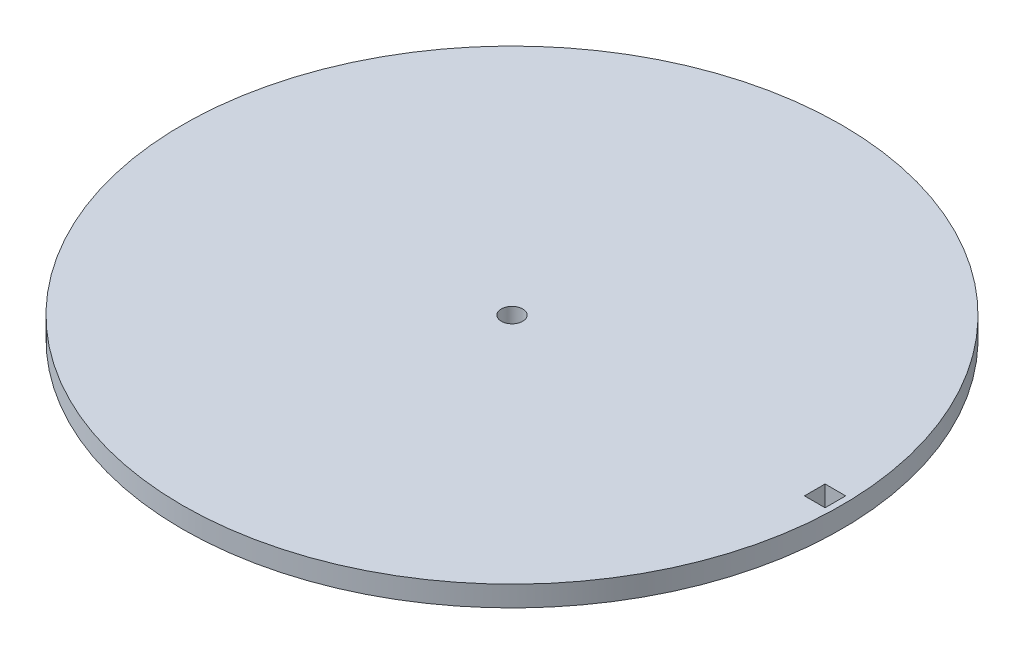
ISO-10303-21;
HEADER;
FILE_DESCRIPTION(('STEP AP214'),'2;1');
FILE_NAME('part.step','',(''),(''),'','','');
FILE_SCHEMA(('AUTOMOTIVE_DESIGN { 1 0 10303 214 1 1 1 1 }'));
ENDSEC;
DATA;
#1=APPLICATION_CONTEXT('core data for automotive mechanical design processes');
#2=APPLICATION_PROTOCOL_DEFINITION('international standard','automotive_design',2000,#1);
#3=PRODUCT_CONTEXT('',#1,'mechanical');
#4=PRODUCT('Part','Part','',(#3));
#5=PRODUCT_RELATED_PRODUCT_CATEGORY('part','',(#4));
#6=PRODUCT_DEFINITION_FORMATION('','',#4);
#7=PRODUCT_DEFINITION_CONTEXT('part definition',#1,'design');
#8=PRODUCT_DEFINITION('design','',#6,#7);
#9=PRODUCT_DEFINITION_SHAPE('','',#8);
#10=(LENGTH_UNIT() NAMED_UNIT(*) SI_UNIT(.MILLI.,.METRE.));
#11=(NAMED_UNIT(*) PLANE_ANGLE_UNIT() SI_UNIT($,.RADIAN.));
#12=(NAMED_UNIT(*) SI_UNIT($,.STERADIAN.) SOLID_ANGLE_UNIT());
#13=UNCERTAINTY_MEASURE_WITH_UNIT(LENGTH_MEASURE(1.E-05),#10,'distance_accuracy_value','');
#14=(GEOMETRIC_REPRESENTATION_CONTEXT(3) GLOBAL_UNCERTAINTY_ASSIGNED_CONTEXT((#13)) GLOBAL_UNIT_ASSIGNED_CONTEXT((#10,
#11,#12)) REPRESENTATION_CONTEXT('',''));
#15=CARTESIAN_POINT('',(0.,0.,0.));
#16=DIRECTION('',(0.,0.,1.));
#17=DIRECTION('',(1.,0.,0.));
#18=AXIS2_PLACEMENT_3D('',#15,#16,#17);
#19=CARTESIAN_POINT('',(0.,3.175,0.));
#20=DIRECTION('',(0.,-1.,0.));
#21=DIRECTION('',(0.,0.,-1.));
#22=AXIS2_PLACEMENT_3D('',#19,#20,#21);
#23=CYLINDRICAL_SURFACE('',#22,50.8);
#24=CARTESIAN_POINT('',(0.,3.175,0.));
#25=DIRECTION('',(0.,1.,0.));
#26=DIRECTION('',(0.,0.,1.));
#27=AXIS2_PLACEMENT_3D('',#24,#25,#26);
#28=CIRCLE('',#27,50.8);
#29=CARTESIAN_POINT('',(0.,3.175,50.8));
#30=VERTEX_POINT('',#29);
#31=EDGE_CURVE('E11',#30,#30,#28,.T.);
#32=ORIENTED_EDGE('',*,*,#31,.F.);
#33=EDGE_LOOP('',(#32));
#34=FACE_BOUND('',#33,.T.);
#35=CARTESIAN_POINT('',(0.,0.,0.));
#36=DIRECTION('',(0.,1.,0.));
#37=DIRECTION('',(0.,0.,1.));
#38=AXIS2_PLACEMENT_3D('',#35,#36,#37);
#39=CIRCLE('',#38,50.8);
#40=CARTESIAN_POINT('',(0.,0.,50.8));
#41=VERTEX_POINT('',#40);
#42=EDGE_CURVE('E35',#41,#41,#39,.T.);
#43=ORIENTED_EDGE('',*,*,#42,.T.);
#44=EDGE_LOOP('',(#43));
#45=FACE_BOUND('',#44,.T.);
#46=ADVANCED_FACE('F32',(#34,#45),#23,.T.);
#47=CARTESIAN_POINT('',(0.,3.175,0.));
#48=DIRECTION('',(0.,1.,0.));
#49=DIRECTION('',(0.,0.,1.));
#50=AXIS2_PLACEMENT_3D('',#47,#48,#49);
#51=PLANE('',#50);
#52=DIRECTION('',(0.,0.,1.));
#53=VECTOR('',#52,1.);
#54=CARTESIAN_POINT('',(46.6725,3.175,1.5875));
#55=LINE('',#54,#53);
#56=CARTESIAN_POINT('',(46.6725,3.175,-1.5875));
#57=VERTEX_POINT('',#56);
#58=CARTESIAN_POINT('',(46.6725,3.175,1.5875));
#59=VERTEX_POINT('',#58);
#60=EDGE_CURVE('E46',#57,#59,#55,.T.);
#61=ORIENTED_EDGE('',*,*,#60,.F.);
#62=DIRECTION('',(-1.,0.,0.));
#63=VECTOR('',#62,1.);
#64=CARTESIAN_POINT('',(49.8475,3.175,-1.5875));
#65=LINE('',#64,#63);
#66=CARTESIAN_POINT('',(49.8475,3.175,-1.5875));
#67=VERTEX_POINT('',#66);
#68=EDGE_CURVE('E90',#67,#57,#65,.T.);
#69=ORIENTED_EDGE('',*,*,#68,.F.);
#70=DIRECTION('',(0.,0.,-1.));
#71=VECTOR('',#70,1.);
#72=CARTESIAN_POINT('',(49.8475,3.175,1.5875));
#73=LINE('',#72,#71);
#74=CARTESIAN_POINT('',(49.8475,3.175,1.5875));
#75=VERTEX_POINT('',#74);
#76=EDGE_CURVE('E93',#75,#67,#73,.T.);
#77=ORIENTED_EDGE('',*,*,#76,.F.);
#78=DIRECTION('',(1.,0.,0.));
#79=VECTOR('',#78,1.);
#80=CARTESIAN_POINT('',(49.8475,3.175,1.5875));
#81=LINE('',#80,#79);
#82=EDGE_CURVE('E99',#59,#75,#81,.T.);
#83=ORIENTED_EDGE('',*,*,#82,.F.);
#84=EDGE_LOOP('',(#61,#69,#77,#83));
#85=FACE_BOUND('',#84,.T.);
#86=CARTESIAN_POINT('',(0.,3.175,0.));
#87=DIRECTION('',(0.,-1.,0.));
#88=DIRECTION('',(0.,0.,-1.));
#89=AXIS2_PLACEMENT_3D('',#86,#87,#88);
#90=CIRCLE('',#89,1.651);
#91=CARTESIAN_POINT('',(0.,3.175,-1.651));
#92=VERTEX_POINT('',#91);
#93=EDGE_CURVE('E109',#92,#92,#90,.T.);
#94=ORIENTED_EDGE('',*,*,#93,.T.);
#95=EDGE_LOOP('',(#94));
#96=FACE_BOUND('',#95,.T.);
#97=ORIENTED_EDGE('',*,*,#31,.T.);
#98=EDGE_LOOP('',(#97));
#99=FACE_BOUND('',#98,.T.);
#100=ADVANCED_FACE('F118',(#85,#96,#99),#51,.T.);
#101=CARTESIAN_POINT('',(0.,0.,0.));
#102=DIRECTION('',(0.,1.,0.));
#103=DIRECTION('',(0.,0.,1.));
#104=AXIS2_PLACEMENT_3D('',#101,#102,#103);
#105=PLANE('',#104);
#106=DIRECTION('',(-1.,0.,0.));
#107=VECTOR('',#106,1.);
#108=CARTESIAN_POINT('',(49.8475,0.,-1.5875));
#109=LINE('',#108,#107);
#110=CARTESIAN_POINT('',(49.8475,0.,-1.5875));
#111=VERTEX_POINT('',#110);
#112=CARTESIAN_POINT('',(46.6725,0.,-1.5875));
#113=VERTEX_POINT('',#112);
#114=EDGE_CURVE('E80',#111,#113,#109,.T.);
#115=ORIENTED_EDGE('',*,*,#114,.T.);
#116=DIRECTION('',(0.,0.,1.));
#117=VECTOR('',#116,1.);
#118=CARTESIAN_POINT('',(46.6725,0.,1.5875));
#119=LINE('',#118,#117);
#120=CARTESIAN_POINT('',(46.6725,0.,1.5875));
#121=VERTEX_POINT('',#120);
#122=EDGE_CURVE('E74',#113,#121,#119,.T.);
#123=ORIENTED_EDGE('',*,*,#122,.T.);
#124=DIRECTION('',(1.,0.,0.));
#125=VECTOR('',#124,1.);
#126=CARTESIAN_POINT('',(49.8475,0.,1.5875));
#127=LINE('',#126,#125);
#128=CARTESIAN_POINT('',(49.8475,0.,1.5875));
#129=VERTEX_POINT('',#128);
#130=EDGE_CURVE('E83',#121,#129,#127,.T.);
#131=ORIENTED_EDGE('',*,*,#130,.T.);
#132=DIRECTION('',(0.,0.,-1.));
#133=VECTOR('',#132,1.);
#134=CARTESIAN_POINT('',(49.8475,0.,1.5875));
#135=LINE('',#134,#133);
#136=EDGE_CURVE('E54',#129,#111,#135,.T.);
#137=ORIENTED_EDGE('',*,*,#136,.T.);
#138=EDGE_LOOP('',(#115,#123,#131,#137));
#139=FACE_BOUND('',#138,.T.);
#140=CARTESIAN_POINT('',(0.,0.,0.));
#141=DIRECTION('',(0.,-1.,0.));
#142=DIRECTION('',(0.,0.,-1.));
#143=AXIS2_PLACEMENT_3D('',#140,#141,#142);
#144=CIRCLE('',#143,1.651);
#145=CARTESIAN_POINT('',(0.,0.,-1.651));
#146=VERTEX_POINT('',#145);
#147=EDGE_CURVE('E105',#146,#146,#144,.T.);
#148=ORIENTED_EDGE('',*,*,#147,.F.);
#149=EDGE_LOOP('',(#148));
#150=FACE_BOUND('',#149,.T.);
#151=ORIENTED_EDGE('',*,*,#42,.F.);
#152=EDGE_LOOP('',(#151));
#153=FACE_BOUND('',#152,.T.);
#154=ADVANCED_FACE('F87',(#139,#150,#153),#105,.F.);
#155=CARTESIAN_POINT('',(0.,3.175,0.));
#156=DIRECTION('',(0.,-1.,0.));
#157=DIRECTION('',(0.,0.,-1.));
#158=AXIS2_PLACEMENT_3D('',#155,#156,#157);
#159=CYLINDRICAL_SURFACE('',#158,1.651);
#160=ORIENTED_EDGE('',*,*,#93,.F.);
#161=EDGE_LOOP('',(#160));
#162=FACE_BOUND('',#161,.T.);
#163=ORIENTED_EDGE('',*,*,#147,.T.);
#164=EDGE_LOOP('',(#163));
#165=FACE_BOUND('',#164,.T.);
#166=ADVANCED_FACE('F115',(#162,#165),#159,.F.);
#167=CARTESIAN_POINT('',(46.6725,0.,1.5875));
#168=DIRECTION('',(-1.,0.,0.));
#169=DIRECTION('',(0.,0.,1.));
#170=AXIS2_PLACEMENT_3D('',#167,#168,#169);
#171=PLANE('',#170);
#172=ORIENTED_EDGE('',*,*,#60,.T.);
#173=DIRECTION('',(0.,1.,0.));
#174=VECTOR('',#173,1.);
#175=CARTESIAN_POINT('',(46.6725,0.,1.5875));
#176=LINE('',#175,#174);
#177=EDGE_CURVE('E70',#121,#59,#176,.T.);
#178=ORIENTED_EDGE('',*,*,#177,.F.);
#179=ORIENTED_EDGE('',*,*,#122,.F.);
#180=DIRECTION('',(0.,1.,0.));
#181=VECTOR('',#180,1.);
#182=CARTESIAN_POINT('',(46.6725,0.,-1.5875));
#183=LINE('',#182,#181);
#184=EDGE_CURVE('E103',#113,#57,#183,.T.);
#185=ORIENTED_EDGE('',*,*,#184,.T.);
#186=EDGE_LOOP('',(#172,#178,#179,#185));
#187=FACE_BOUND('',#186,.T.);
#188=ADVANCED_FACE('F72',(#187),#171,.F.);
#189=CARTESIAN_POINT('',(49.8475,0.,-1.5875));
#190=DIRECTION('',(0.,0.,-1.));
#191=DIRECTION('',(-1.,0.,0.));
#192=AXIS2_PLACEMENT_3D('',#189,#190,#191);
#193=PLANE('',#192);
#194=ORIENTED_EDGE('',*,*,#68,.T.);
#195=ORIENTED_EDGE('',*,*,#184,.F.);
#196=ORIENTED_EDGE('',*,*,#114,.F.);
#197=DIRECTION('',(0.,1.,0.));
#198=VECTOR('',#197,1.);
#199=CARTESIAN_POINT('',(49.8475,0.,-1.5875));
#200=LINE('',#199,#198);
#201=EDGE_CURVE('E106',#111,#67,#200,.T.);
#202=ORIENTED_EDGE('',*,*,#201,.T.);
#203=EDGE_LOOP('',(#194,#195,#196,#202));
#204=FACE_BOUND('',#203,.T.);
#205=ADVANCED_FACE('F140',(#204),#193,.F.);
#206=CARTESIAN_POINT('',(49.8475,0.,1.5875));
#207=DIRECTION('',(1.,0.,0.));
#208=DIRECTION('',(0.,0.,-1.));
#209=AXIS2_PLACEMENT_3D('',#206,#207,#208);
#210=PLANE('',#209);
#211=ORIENTED_EDGE('',*,*,#76,.T.);
#212=ORIENTED_EDGE('',*,*,#201,.F.);
#213=ORIENTED_EDGE('',*,*,#136,.F.);
#214=DIRECTION('',(0.,1.,0.));
#215=VECTOR('',#214,1.);
#216=CARTESIAN_POINT('',(49.8475,0.,1.5875));
#217=LINE('',#216,#215);
#218=EDGE_CURVE('E79',#129,#75,#217,.T.);
#219=ORIENTED_EDGE('',*,*,#218,.T.);
#220=EDGE_LOOP('',(#211,#212,#213,#219));
#221=FACE_BOUND('',#220,.T.);
#222=ADVANCED_FACE('F143',(#221),#210,.F.);
#223=CARTESIAN_POINT('',(49.8475,0.,1.5875));
#224=DIRECTION('',(0.,0.,1.));
#225=DIRECTION('',(1.,0.,0.));
#226=AXIS2_PLACEMENT_3D('',#223,#224,#225);
#227=PLANE('',#226);
#228=ORIENTED_EDGE('',*,*,#82,.T.);
#229=ORIENTED_EDGE('',*,*,#218,.F.);
#230=ORIENTED_EDGE('',*,*,#130,.F.);
#231=ORIENTED_EDGE('',*,*,#177,.T.);
#232=EDGE_LOOP('',(#228,#229,#230,#231));
#233=FACE_BOUND('',#232,.T.);
#234=ADVANCED_FACE('F84',(#233),#227,.F.);
#235=CLOSED_SHELL('',(#46,#100,#154,#166,#188,#205,#222,#234));
#236=MANIFOLD_SOLID_BREP('B2',#235);
#237=ADVANCED_BREP_SHAPE_REPRESENTATION('',(#18,#236),#14);
#238=SHAPE_DEFINITION_REPRESENTATION(#9,#237);
ENDSEC;
END-ISO-10303-21;
